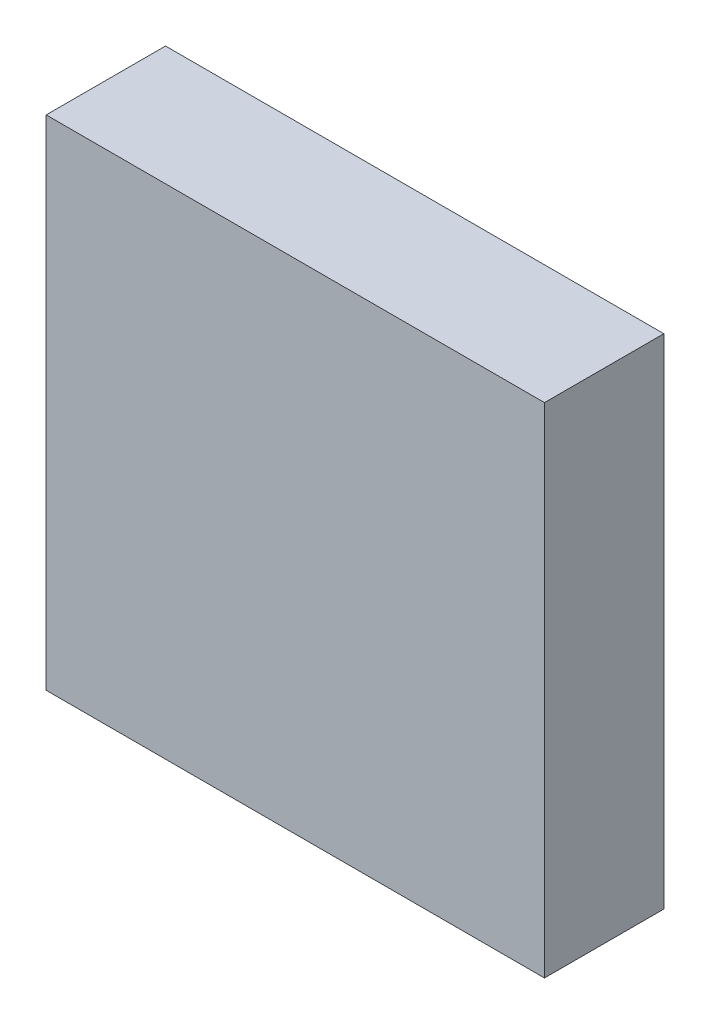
ISO-10303-21;
HEADER;
FILE_DESCRIPTION(('STEP AP214'),'2;1');
FILE_NAME('part.step','',(''),(''),'','','');
FILE_SCHEMA(('AUTOMOTIVE_DESIGN { 1 0 10303 214 1 1 1 1 }'));
ENDSEC;
DATA;
#1=APPLICATION_CONTEXT('core data for automotive mechanical design processes');
#2=APPLICATION_PROTOCOL_DEFINITION('international standard','automotive_design',2000,#1);
#3=PRODUCT_CONTEXT('',#1,'mechanical');
#4=PRODUCT('Part','Part','',(#3));
#5=PRODUCT_RELATED_PRODUCT_CATEGORY('part','',(#4));
#6=PRODUCT_DEFINITION_FORMATION('','',#4);
#7=PRODUCT_DEFINITION_CONTEXT('part definition',#1,'design');
#8=PRODUCT_DEFINITION('design','',#6,#7);
#9=PRODUCT_DEFINITION_SHAPE('','',#8);
#10=(LENGTH_UNIT() NAMED_UNIT(*) SI_UNIT(.MILLI.,.METRE.));
#11=(NAMED_UNIT(*) PLANE_ANGLE_UNIT() SI_UNIT($,.RADIAN.));
#12=(NAMED_UNIT(*) SI_UNIT($,.STERADIAN.) SOLID_ANGLE_UNIT());
#13=UNCERTAINTY_MEASURE_WITH_UNIT(LENGTH_MEASURE(1.E-05),#10,'distance_accuracy_value','');
#14=(GEOMETRIC_REPRESENTATION_CONTEXT(3) GLOBAL_UNCERTAINTY_ASSIGNED_CONTEXT((#13)) GLOBAL_UNIT_ASSIGNED_CONTEXT((#10,
#11,#12)) REPRESENTATION_CONTEXT('',''));
#15=CARTESIAN_POINT('',(0.,0.,0.));
#16=DIRECTION('',(0.,0.,1.));
#17=DIRECTION('',(1.,0.,0.));
#18=AXIS2_PLACEMENT_3D('',#15,#16,#17);
#19=CARTESIAN_POINT('',(-15.875,15.875,0.254));
#20=DIRECTION('',(0.,1.,0.));
#21=DIRECTION('',(-1.,0.,0.));
#22=AXIS2_PLACEMENT_3D('',#19,#20,#21);
#23=PLANE('',#22);
#24=DIRECTION('',(0.,0.,1.));
#25=VECTOR('',#24,1.);
#26=CARTESIAN_POINT('',(-15.875,15.875,0.254));
#27=LINE('',#26,#25);
#28=CARTESIAN_POINT('',(-15.875,15.875,0.));
#29=VERTEX_POINT('',#28);
#30=CARTESIAN_POINT('',(-15.875,15.875,7.60400000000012));
#31=VERTEX_POINT('',#30);
#32=EDGE_CURVE('E61',#29,#31,#27,.T.);
#33=ORIENTED_EDGE('',*,*,#32,.T.);
#34=DIRECTION('',(-1.,0.,0.));
#35=VECTOR('',#34,1.);
#36=CARTESIAN_POINT('',(15.875,15.875,7.60400000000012));
#37=LINE('',#36,#35);
#38=CARTESIAN_POINT('',(15.875,15.875,7.60400000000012));
#39=VERTEX_POINT('',#38);
#40=EDGE_CURVE('E73',#39,#31,#37,.T.);
#41=ORIENTED_EDGE('',*,*,#40,.F.);
#42=DIRECTION('',(0.,0.,1.));
#43=VECTOR('',#42,1.);
#44=CARTESIAN_POINT('',(15.875,15.875,0.254));
#45=LINE('',#44,#43);
#46=CARTESIAN_POINT('',(15.875,15.875,0.));
#47=VERTEX_POINT('',#46);
#48=EDGE_CURVE('E80',#47,#39,#45,.T.);
#49=ORIENTED_EDGE('',*,*,#48,.F.);
#50=DIRECTION('',(-1.,0.,0.));
#51=VECTOR('',#50,1.);
#52=CARTESIAN_POINT('',(-15.875,15.875,0.));
#53=LINE('',#52,#51);
#54=EDGE_CURVE('E83',#47,#29,#53,.T.);
#55=ORIENTED_EDGE('',*,*,#54,.T.);
#56=EDGE_LOOP('',(#33,#41,#49,#55));
#57=FACE_BOUND('',#56,.T.);
#58=ADVANCED_FACE('F14',(#57),#23,.T.);
#59=CARTESIAN_POINT('',(15.875,15.875,0.254));
#60=DIRECTION('',(1.,0.,0.));
#61=DIRECTION('',(0.,1.,0.));
#62=AXIS2_PLACEMENT_3D('',#59,#60,#61);
#63=PLANE('',#62);
#64=ORIENTED_EDGE('',*,*,#48,.T.);
#65=DIRECTION('',(0.,1.,0.));
#66=VECTOR('',#65,1.);
#67=CARTESIAN_POINT('',(15.875,-15.875,7.60400000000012));
#68=LINE('',#67,#66);
#69=CARTESIAN_POINT('',(15.875,-15.875,7.60400000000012));
#70=VERTEX_POINT('',#69);
#71=EDGE_CURVE('E68',#70,#39,#68,.T.);
#72=ORIENTED_EDGE('',*,*,#71,.F.);
#73=DIRECTION('',(0.,0.,1.));
#74=VECTOR('',#73,1.);
#75=CARTESIAN_POINT('',(15.875,-15.875,0.254));
#76=LINE('',#75,#74);
#77=CARTESIAN_POINT('',(15.875,-15.875,0.));
#78=VERTEX_POINT('',#77);
#79=EDGE_CURVE('E9',#78,#70,#76,.T.);
#80=ORIENTED_EDGE('',*,*,#79,.F.);
#81=DIRECTION('',(0.,1.,0.));
#82=VECTOR('',#81,1.);
#83=CARTESIAN_POINT('',(15.875,15.875,0.));
#84=LINE('',#83,#82);
#85=EDGE_CURVE('E77',#78,#47,#84,.T.);
#86=ORIENTED_EDGE('',*,*,#85,.T.);
#87=EDGE_LOOP('',(#64,#72,#80,#86));
#88=FACE_BOUND('',#87,.T.);
#89=ADVANCED_FACE('F87',(#88),#63,.T.);
#90=CARTESIAN_POINT('',(-15.875,15.875,0.254));
#91=DIRECTION('',(-1.,0.,0.));
#92=DIRECTION('',(0.,-1.,0.));
#93=AXIS2_PLACEMENT_3D('',#90,#91,#92);
#94=PLANE('',#93);
#95=DIRECTION('',(0.,0.,1.));
#96=VECTOR('',#95,1.);
#97=CARTESIAN_POINT('',(-15.875,-15.875,0.254));
#98=LINE('',#97,#96);
#99=CARTESIAN_POINT('',(-15.875,-15.875,0.));
#100=VERTEX_POINT('',#99);
#101=CARTESIAN_POINT('',(-15.875,-15.875,7.60400000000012));
#102=VERTEX_POINT('',#101);
#103=EDGE_CURVE('E23',#100,#102,#98,.T.);
#104=ORIENTED_EDGE('',*,*,#103,.T.);
#105=DIRECTION('',(0.,-1.,0.));
#106=VECTOR('',#105,1.);
#107=CARTESIAN_POINT('',(-15.875,15.875,7.60400000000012));
#108=LINE('',#107,#106);
#109=EDGE_CURVE('E57',#31,#102,#108,.T.);
#110=ORIENTED_EDGE('',*,*,#109,.F.);
#111=ORIENTED_EDGE('',*,*,#32,.F.);
#112=DIRECTION('',(0.,-1.,0.));
#113=VECTOR('',#112,1.);
#114=CARTESIAN_POINT('',(-15.875,15.875,0.));
#115=LINE('',#114,#113);
#116=EDGE_CURVE('E59',#29,#100,#115,.T.);
#117=ORIENTED_EDGE('',*,*,#116,.T.);
#118=EDGE_LOOP('',(#104,#110,#111,#117));
#119=FACE_BOUND('',#118,.T.);
#120=ADVANCED_FACE('F55',(#119),#94,.T.);
#121=CARTESIAN_POINT('',(-15.875,-15.875,0.254));
#122=DIRECTION('',(0.,-1.,0.));
#123=DIRECTION('',(1.,0.,0.));
#124=AXIS2_PLACEMENT_3D('',#121,#122,#123);
#125=PLANE('',#124);
#126=ORIENTED_EDGE('',*,*,#79,.T.);
#127=DIRECTION('',(1.,0.,0.));
#128=VECTOR('',#127,1.);
#129=CARTESIAN_POINT('',(-15.875,-15.875,7.60400000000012));
#130=LINE('',#129,#128);
#131=EDGE_CURVE('E64',#102,#70,#130,.T.);
#132=ORIENTED_EDGE('',*,*,#131,.F.);
#133=ORIENTED_EDGE('',*,*,#103,.F.);
#134=DIRECTION('',(1.,0.,0.));
#135=VECTOR('',#134,1.);
#136=CARTESIAN_POINT('',(-15.875,-15.875,0.));
#137=LINE('',#136,#135);
#138=EDGE_CURVE('E18',#100,#78,#137,.T.);
#139=ORIENTED_EDGE('',*,*,#138,.T.);
#140=EDGE_LOOP('',(#126,#132,#133,#139));
#141=FACE_BOUND('',#140,.T.);
#142=ADVANCED_FACE('F65',(#141),#125,.T.);
#143=CARTESIAN_POINT('',(0.,0.,0.));
#144=DIRECTION('',(0.,0.,1.));
#145=DIRECTION('',(0.,-1.,0.));
#146=AXIS2_PLACEMENT_3D('',#143,#144,#145);
#147=PLANE('',#146);
#148=ORIENTED_EDGE('',*,*,#85,.F.);
#149=ORIENTED_EDGE('',*,*,#138,.F.);
#150=ORIENTED_EDGE('',*,*,#116,.F.);
#151=ORIENTED_EDGE('',*,*,#54,.F.);
#152=EDGE_LOOP('',(#148,#149,#150,#151));
#153=FACE_BOUND('',#152,.T.);
#154=ADVANCED_FACE('F16',(#153),#147,.F.);
#155=CARTESIAN_POINT('',(0.,0.,7.60400000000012));
#156=DIRECTION('',(0.,0.,1.));
#157=DIRECTION('',(1.,0.,0.));
#158=AXIS2_PLACEMENT_3D('',#155,#156,#157);
#159=PLANE('',#158);
#160=ORIENTED_EDGE('',*,*,#109,.T.);
#161=ORIENTED_EDGE('',*,*,#131,.T.);
#162=ORIENTED_EDGE('',*,*,#71,.T.);
#163=ORIENTED_EDGE('',*,*,#40,.T.);
#164=EDGE_LOOP('',(#160,#161,#162,#163));
#165=FACE_BOUND('',#164,.T.);
#166=ADVANCED_FACE('F71',(#165),#159,.T.);
#167=CLOSED_SHELL('',(#58,#89,#120,#142,#154,#166));
#168=MANIFOLD_SOLID_BREP('B1',#167);
#169=ADVANCED_BREP_SHAPE_REPRESENTATION('',(#18,#168),#14);
#170=SHAPE_DEFINITION_REPRESENTATION(#9,#169);
ENDSEC;
END-ISO-10303-21;
